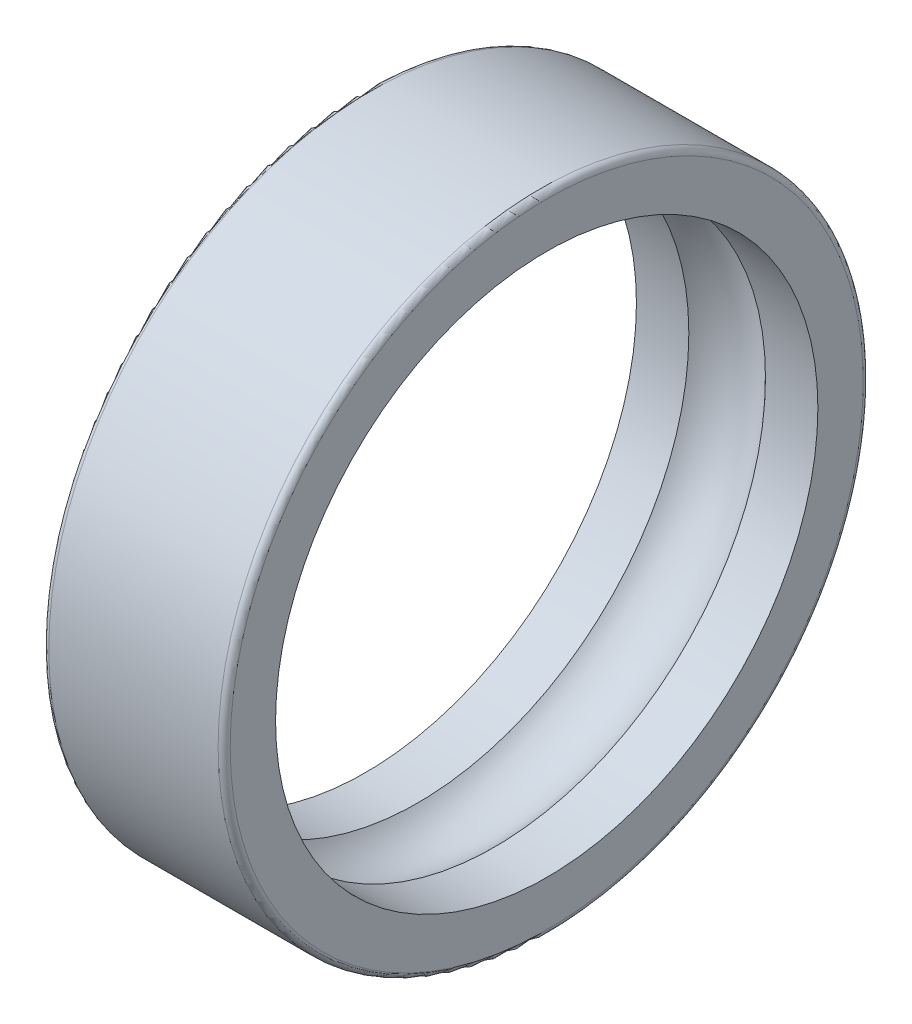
ISO-10303-21;
HEADER;
FILE_DESCRIPTION(('STEP AP214'),'2;1');
FILE_NAME('part.step','',(''),(''),'','','');
FILE_SCHEMA(('AUTOMOTIVE_DESIGN { 1 0 10303 214 1 1 1 1 }'));
ENDSEC;
DATA;
#1=APPLICATION_CONTEXT('core data for automotive mechanical design processes');
#2=APPLICATION_PROTOCOL_DEFINITION('international standard','automotive_design',2000,#1);
#3=PRODUCT_CONTEXT('',#1,'mechanical');
#4=PRODUCT('Part','Part','',(#3));
#5=PRODUCT_RELATED_PRODUCT_CATEGORY('part','',(#4));
#6=PRODUCT_DEFINITION_FORMATION('','',#4);
#7=PRODUCT_DEFINITION_CONTEXT('part definition',#1,'design');
#8=PRODUCT_DEFINITION('design','',#6,#7);
#9=PRODUCT_DEFINITION_SHAPE('','',#8);
#10=(LENGTH_UNIT() NAMED_UNIT(*) SI_UNIT(.MILLI.,.METRE.));
#11=(NAMED_UNIT(*) PLANE_ANGLE_UNIT() SI_UNIT($,.RADIAN.));
#12=(NAMED_UNIT(*) SI_UNIT($,.STERADIAN.) SOLID_ANGLE_UNIT());
#13=UNCERTAINTY_MEASURE_WITH_UNIT(LENGTH_MEASURE(1.E-05),#10,'distance_accuracy_value','');
#14=(GEOMETRIC_REPRESENTATION_CONTEXT(3) GLOBAL_UNCERTAINTY_ASSIGNED_CONTEXT((#13)) GLOBAL_UNIT_ASSIGNED_CONTEXT((#10,
#11,#12)) REPRESENTATION_CONTEXT('',''));
#15=CARTESIAN_POINT('',(0.,0.,0.));
#16=DIRECTION('',(0.,0.,1.));
#17=DIRECTION('',(1.,0.,0.));
#18=AXIS2_PLACEMENT_3D('',#15,#16,#17);
#19=CARTESIAN_POINT('',(0.300000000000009,0.,0.));
#20=DIRECTION('',(-1.,0.,0.));
#21=DIRECTION('',(0.,0.,1.));
#22=AXIS2_PLACEMENT_3D('',#19,#20,#21);
#23=TOROIDAL_SURFACE('',#22,15.7,0.300000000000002);
#24=CARTESIAN_POINT('',(0.,0.,0.));
#25=DIRECTION('',(-1.,0.,0.));
#26=DIRECTION('',(0.,0.,1.));
#27=AXIS2_PLACEMENT_3D('',#24,#25,#26);
#28=CIRCLE('',#27,15.7);
#29=CARTESIAN_POINT('',(0.,0.,15.7));
#30=VERTEX_POINT('',#29);
#31=EDGE_CURVE('E10',#30,#30,#28,.T.);
#32=ORIENTED_EDGE('',*,*,#31,.F.);
#33=EDGE_LOOP('',(#32));
#34=FACE_BOUND('',#33,.T.);
#35=CARTESIAN_POINT('',(0.300000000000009,0.,0.));
#36=DIRECTION('',(-1.,0.,0.));
#37=DIRECTION('',(0.,0.,1.));
#38=AXIS2_PLACEMENT_3D('',#35,#36,#37);
#39=CIRCLE('',#38,16.);
#40=CARTESIAN_POINT('',(0.300000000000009,0.,16.));
#41=VERTEX_POINT('',#40);
#42=EDGE_CURVE('E56',#41,#41,#39,.T.);
#43=ORIENTED_EDGE('',*,*,#42,.T.);
#44=EDGE_LOOP('',(#43));
#45=FACE_BOUND('',#44,.T.);
#46=ADVANCED_FACE('F28',(#34,#45),#23,.T.);
#47=CARTESIAN_POINT('',(0.,0.,-15.7));
#48=DIRECTION('',(1.,0.,0.));
#49=DIRECTION('',(0.,0.,-1.));
#50=AXIS2_PLACEMENT_3D('',#47,#48,#49);
#51=PLANE('',#50);
#52=CARTESIAN_POINT('',(0.,0.,0.));
#53=DIRECTION('',(-1.,0.,0.));
#54=DIRECTION('',(0.,0.,1.));
#55=AXIS2_PLACEMENT_3D('',#52,#53,#54);
#56=CIRCLE('',#55,13.45);
#57=CARTESIAN_POINT('',(0.,0.,13.45));
#58=VERTEX_POINT('',#57);
#59=EDGE_CURVE('E34',#58,#58,#56,.T.);
#60=ORIENTED_EDGE('',*,*,#59,.F.);
#61=EDGE_LOOP('',(#60));
#62=FACE_BOUND('',#61,.T.);
#63=ORIENTED_EDGE('',*,*,#31,.T.);
#64=EDGE_LOOP('',(#63));
#65=FACE_BOUND('',#64,.T.);
#66=ADVANCED_FACE('F93',(#62,#65),#51,.F.);
#67=CARTESIAN_POINT('',(0.,0.,0.));
#68=DIRECTION('',(-1.,0.,0.));
#69=DIRECTION('',(0.,0.,1.));
#70=AXIS2_PLACEMENT_3D('',#67,#68,#69);
#71=CYLINDRICAL_SURFACE('',#70,13.45);
#72=CARTESIAN_POINT('',(2.59934221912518,0.,0.));
#73=DIRECTION('',(-1.,0.,0.));
#74=DIRECTION('',(0.,0.,1.));
#75=AXIS2_PLACEMENT_3D('',#72,#73,#74);
#76=CIRCLE('',#75,13.45);
#77=CARTESIAN_POINT('',(2.59934221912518,0.,13.45));
#78=VERTEX_POINT('',#77);
#79=EDGE_CURVE('E38',#78,#78,#76,.T.);
#80=ORIENTED_EDGE('',*,*,#79,.F.);
#81=EDGE_LOOP('',(#80));
#82=FACE_BOUND('',#81,.T.);
#83=ORIENTED_EDGE('',*,*,#59,.T.);
#84=EDGE_LOOP('',(#83));
#85=FACE_BOUND('',#84,.T.);
#86=ADVANCED_FACE('F88',(#82,#85),#71,.F.);
#87=CARTESIAN_POINT('',(4.50000000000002,0.,0.));
#88=DIRECTION('',(-1.,0.,0.));
#89=DIRECTION('',(0.,0.,1.));
#90=AXIS2_PLACEMENT_3D('',#87,#88,#89);
#91=TOROIDAL_SURFACE('',#90,11.75,2.55);
#92=CARTESIAN_POINT('',(6.40065778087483,0.,0.));
#93=DIRECTION('',(-1.,0.,0.));
#94=DIRECTION('',(0.,0.,1.));
#95=AXIS2_PLACEMENT_3D('',#92,#93,#94);
#96=CIRCLE('',#95,13.45);
#97=CARTESIAN_POINT('',(6.40065778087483,0.,13.45));
#98=VERTEX_POINT('',#97);
#99=EDGE_CURVE('E42',#98,#98,#96,.T.);
#100=ORIENTED_EDGE('',*,*,#99,.F.);
#101=EDGE_LOOP('',(#100));
#102=FACE_BOUND('',#101,.T.);
#103=ORIENTED_EDGE('',*,*,#79,.T.);
#104=EDGE_LOOP('',(#103));
#105=FACE_BOUND('',#104,.T.);
#106=ADVANCED_FACE('F82',(#102,#105),#91,.F.);
#107=CARTESIAN_POINT('',(0.,0.,0.));
#108=DIRECTION('',(-1.,0.,0.));
#109=DIRECTION('',(0.,0.,1.));
#110=AXIS2_PLACEMENT_3D('',#107,#108,#109);
#111=CYLINDRICAL_SURFACE('',#110,13.45);
#112=CARTESIAN_POINT('',(9.00000000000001,0.,0.));
#113=DIRECTION('',(-1.,0.,0.));
#114=DIRECTION('',(0.,0.,1.));
#115=AXIS2_PLACEMENT_3D('',#112,#113,#114);
#116=CIRCLE('',#115,13.45);
#117=CARTESIAN_POINT('',(9.00000000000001,0.,13.45));
#118=VERTEX_POINT('',#117);
#119=EDGE_CURVE('E47',#118,#118,#116,.T.);
#120=ORIENTED_EDGE('',*,*,#119,.F.);
#121=EDGE_LOOP('',(#120));
#122=FACE_BOUND('',#121,.T.);
#123=ORIENTED_EDGE('',*,*,#99,.T.);
#124=EDGE_LOOP('',(#123));
#125=FACE_BOUND('',#124,.T.);
#126=ADVANCED_FACE('F76',(#122,#125),#111,.F.);
#127=CARTESIAN_POINT('',(8.99999999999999,0.,-15.7));
#128=DIRECTION('',(-1.,0.,0.));
#129=DIRECTION('',(0.,0.,1.));
#130=AXIS2_PLACEMENT_3D('',#127,#128,#129);
#131=PLANE('',#130);
#132=CARTESIAN_POINT('',(9.00000000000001,0.,0.));
#133=DIRECTION('',(-1.,0.,0.));
#134=DIRECTION('',(0.,0.,1.));
#135=AXIS2_PLACEMENT_3D('',#132,#133,#134);
#136=CIRCLE('',#135,15.7);
#137=CARTESIAN_POINT('',(9.00000000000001,0.,15.7));
#138=VERTEX_POINT('',#137);
#139=EDGE_CURVE('E50',#138,#138,#136,.T.);
#140=ORIENTED_EDGE('',*,*,#139,.F.);
#141=EDGE_LOOP('',(#140));
#142=FACE_BOUND('',#141,.T.);
#143=ORIENTED_EDGE('',*,*,#119,.T.);
#144=EDGE_LOOP('',(#143));
#145=FACE_BOUND('',#144,.T.);
#146=ADVANCED_FACE('F70',(#142,#145),#131,.F.);
#147=CARTESIAN_POINT('',(8.7,0.,0.));
#148=DIRECTION('',(-1.,0.,0.));
#149=DIRECTION('',(0.,0.,1.));
#150=AXIS2_PLACEMENT_3D('',#147,#148,#149);
#151=TOROIDAL_SURFACE('',#150,15.7,0.300000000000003);
#152=CARTESIAN_POINT('',(8.7,0.,0.));
#153=DIRECTION('',(-1.,0.,0.));
#154=DIRECTION('',(0.,0.,1.));
#155=AXIS2_PLACEMENT_3D('',#152,#153,#154);
#156=CIRCLE('',#155,16.);
#157=CARTESIAN_POINT('',(8.7,0.,16.));
#158=VERTEX_POINT('',#157);
#159=EDGE_CURVE('E53',#158,#158,#156,.T.);
#160=ORIENTED_EDGE('',*,*,#159,.F.);
#161=EDGE_LOOP('',(#160));
#162=FACE_BOUND('',#161,.T.);
#163=ORIENTED_EDGE('',*,*,#139,.T.);
#164=EDGE_LOOP('',(#163));
#165=FACE_BOUND('',#164,.T.);
#166=ADVANCED_FACE('F64',(#162,#165),#151,.T.);
#167=CARTESIAN_POINT('',(0.,0.,0.));
#168=DIRECTION('',(-1.,0.,0.));
#169=DIRECTION('',(0.,0.,1.));
#170=AXIS2_PLACEMENT_3D('',#167,#168,#169);
#171=CYLINDRICAL_SURFACE('',#170,16.);
#172=ORIENTED_EDGE('',*,*,#42,.F.);
#173=EDGE_LOOP('',(#172));
#174=FACE_BOUND('',#173,.T.);
#175=ORIENTED_EDGE('',*,*,#159,.T.);
#176=EDGE_LOOP('',(#175));
#177=FACE_BOUND('',#176,.T.);
#178=ADVANCED_FACE('F61',(#174,#177),#171,.T.);
#179=CLOSED_SHELL('',(#46,#66,#86,#106,#126,#146,#166,#178));
#180=MANIFOLD_SOLID_BREP('B2',#179);
#181=ADVANCED_BREP_SHAPE_REPRESENTATION('',(#18,#180),#14);
#182=SHAPE_DEFINITION_REPRESENTATION(#9,#181);
ENDSEC;
END-ISO-10303-21;
